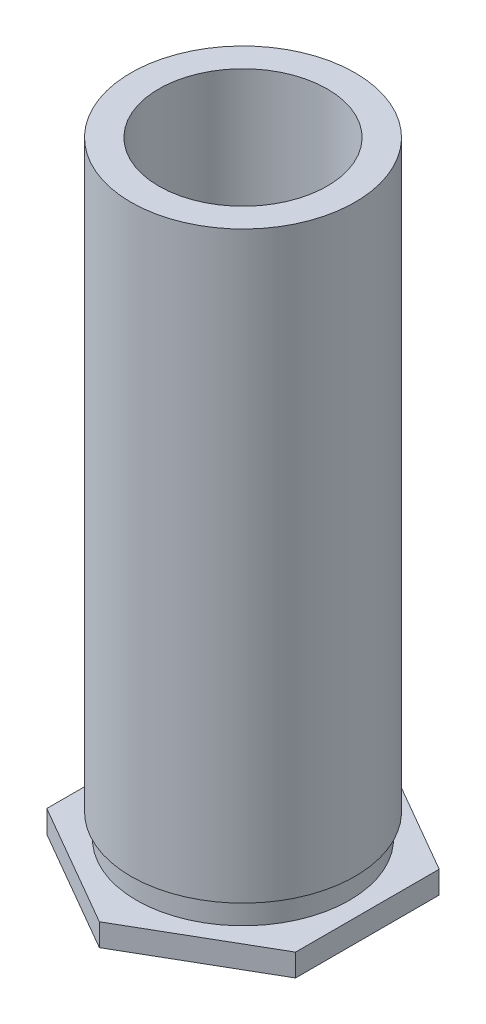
ISO-10303-21;
HEADER;
FILE_DESCRIPTION(('STEP AP214'),'2;1');
FILE_NAME('part.step','',(''),(''),'','','');
FILE_SCHEMA(('AUTOMOTIVE_DESIGN { 1 0 10303 214 1 1 1 1 }'));
ENDSEC;
DATA;
#1=APPLICATION_CONTEXT('core data for automotive mechanical design processes');
#2=APPLICATION_PROTOCOL_DEFINITION('international standard','automotive_design',2000,#1);
#3=PRODUCT_CONTEXT('',#1,'mechanical');
#4=PRODUCT('Part','Part','',(#3));
#5=PRODUCT_RELATED_PRODUCT_CATEGORY('part','',(#4));
#6=PRODUCT_DEFINITION_FORMATION('','',#4);
#7=PRODUCT_DEFINITION_CONTEXT('part definition',#1,'design');
#8=PRODUCT_DEFINITION('design','',#6,#7);
#9=PRODUCT_DEFINITION_SHAPE('','',#8);
#10=(LENGTH_UNIT() NAMED_UNIT(*) SI_UNIT(.MILLI.,.METRE.));
#11=(NAMED_UNIT(*) PLANE_ANGLE_UNIT() SI_UNIT($,.RADIAN.));
#12=(NAMED_UNIT(*) SI_UNIT($,.STERADIAN.) SOLID_ANGLE_UNIT());
#13=UNCERTAINTY_MEASURE_WITH_UNIT(LENGTH_MEASURE(1.E-05),#10,'distance_accuracy_value','');
#14=(GEOMETRIC_REPRESENTATION_CONTEXT(3) GLOBAL_UNCERTAINTY_ASSIGNED_CONTEXT((#13)) GLOBAL_UNIT_ASSIGNED_CONTEXT((#10,
#11,#12)) REPRESENTATION_CONTEXT('',''));
#15=CARTESIAN_POINT('',(0.,0.,0.));
#16=DIRECTION('',(0.,0.,1.));
#17=DIRECTION('',(1.,0.,0.));
#18=AXIS2_PLACEMENT_3D('',#15,#16,#17);
#19=CARTESIAN_POINT('',(4.582,0.712,0.));
#20=DIRECTION('',(0.,1.,0.));
#21=DIRECTION('',(0.,0.,1.));
#22=AXIS2_PLACEMENT_3D('',#19,#20,#21);
#23=PLANE('',#22);
#24=CARTESIAN_POINT('',(0.,0.712,0.));
#25=DIRECTION('',(0.,-1.,0.));
#26=DIRECTION('',(0.,0.,-1.));
#27=AXIS2_PLACEMENT_3D('',#24,#25,#26);
#28=CIRCLE('',#27,3.382);
#29=CARTESIAN_POINT('',(0.,0.712,-3.382));
#30=VERTEX_POINT('',#29);
#31=EDGE_CURVE('E11',#30,#30,#28,.T.);
#32=ORIENTED_EDGE('',*,*,#31,.T.);
#33=EDGE_LOOP('',(#32));
#34=FACE_BOUND('',#33,.T.);
#35=DIRECTION('',(0.866025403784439,0.,0.5));
#36=VECTOR('',#35,1.);
#37=CARTESIAN_POINT('',(0.,0.712,4.56106712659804));
#38=LINE('',#37,#36);
#39=CARTESIAN_POINT('',(-3.95,0.712,2.28053356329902));
#40=VERTEX_POINT('',#39);
#41=CARTESIAN_POINT('',(0.,0.712,4.56106712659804));
#42=VERTEX_POINT('',#41);
#43=EDGE_CURVE('E129',#40,#42,#38,.T.);
#44=ORIENTED_EDGE('',*,*,#43,.T.);
#45=DIRECTION('',(0.866025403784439,0.,-0.5));
#46=VECTOR('',#45,1.);
#47=CARTESIAN_POINT('',(3.95,0.712,2.28053356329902));
#48=LINE('',#47,#46);
#49=CARTESIAN_POINT('',(3.95,0.712,2.28053356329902));
#50=VERTEX_POINT('',#49);
#51=EDGE_CURVE('E118',#42,#50,#48,.T.);
#52=ORIENTED_EDGE('',*,*,#51,.T.);
#53=DIRECTION('',(0.,0.,-1.));
#54=VECTOR('',#53,1.);
#55=CARTESIAN_POINT('',(3.95,0.712,-2.28053356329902));
#56=LINE('',#55,#54);
#57=CARTESIAN_POINT('',(3.95,0.712,-2.28053356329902));
#58=VERTEX_POINT('',#57);
#59=EDGE_CURVE('E121',#50,#58,#56,.T.);
#60=ORIENTED_EDGE('',*,*,#59,.T.);
#61=DIRECTION('',(-0.866025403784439,0.,-0.5));
#62=VECTOR('',#61,1.);
#63=CARTESIAN_POINT('',(0.,0.712,-4.56106712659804));
#64=LINE('',#63,#62);
#65=CARTESIAN_POINT('',(0.,0.712,-4.56106712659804));
#66=VERTEX_POINT('',#65);
#67=EDGE_CURVE('E49',#58,#66,#64,.T.);
#68=ORIENTED_EDGE('',*,*,#67,.T.);
#69=DIRECTION('',(-0.866025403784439,0.,0.5));
#70=VECTOR('',#69,1.);
#71=CARTESIAN_POINT('',(-3.95,0.712,-2.28053356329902));
#72=LINE('',#71,#70);
#73=CARTESIAN_POINT('',(-3.95,0.712,-2.28053356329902));
#74=VERTEX_POINT('',#73);
#75=EDGE_CURVE('E94',#66,#74,#72,.T.);
#76=ORIENTED_EDGE('',*,*,#75,.T.);
#77=DIRECTION('',(0.,0.,1.));
#78=VECTOR('',#77,1.);
#79=CARTESIAN_POINT('',(-3.95,0.712,2.28053356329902));
#80=LINE('',#79,#78);
#81=EDGE_CURVE('E126',#74,#40,#80,.T.);
#82=ORIENTED_EDGE('',*,*,#81,.T.);
#83=EDGE_LOOP('',(#44,#52,#60,#68,#76,#82));
#84=FACE_BOUND('',#83,.T.);
#85=ADVANCED_FACE('F33',(#34,#84),#23,.T.);
#86=CARTESIAN_POINT('',(3.56,0.,0.));
#87=DIRECTION('',(0.,-1.,0.));
#88=DIRECTION('',(0.,0.,-1.));
#89=AXIS2_PLACEMENT_3D('',#86,#87,#88);
#90=PLANE('',#89);
#91=CARTESIAN_POINT('',(0.,0.,0.));
#92=DIRECTION('',(0.,-1.,0.));
#93=DIRECTION('',(0.,0.,-1.));
#94=AXIS2_PLACEMENT_3D('',#91,#92,#93);
#95=CIRCLE('',#94,3.56);
#96=CARTESIAN_POINT('',(0.,0.,-3.56));
#97=VERTEX_POINT('',#96);
#98=EDGE_CURVE('E281',#97,#97,#95,.T.);
#99=ORIENTED_EDGE('',*,*,#98,.F.);
#100=EDGE_LOOP('',(#99));
#101=FACE_BOUND('',#100,.T.);
#102=DIRECTION('',(0.,0.,-1.));
#103=VECTOR('',#102,1.);
#104=CARTESIAN_POINT('',(3.95,0.,-2.28053356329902));
#105=LINE('',#104,#103);
#106=CARTESIAN_POINT('',(3.95,0.,2.28053356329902));
#107=VERTEX_POINT('',#106);
#108=CARTESIAN_POINT('',(3.95,0.,-2.28053356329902));
#109=VERTEX_POINT('',#108);
#110=EDGE_CURVE('E104',#107,#109,#105,.T.);
#111=ORIENTED_EDGE('',*,*,#110,.F.);
#112=DIRECTION('',(0.866025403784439,0.,-0.5));
#113=VECTOR('',#112,1.);
#114=CARTESIAN_POINT('',(3.95,0.,2.28053356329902));
#115=LINE('',#114,#113);
#116=CARTESIAN_POINT('',(0.,0.,4.56106712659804));
#117=VERTEX_POINT('',#116);
#118=EDGE_CURVE('E57',#117,#107,#115,.T.);
#119=ORIENTED_EDGE('',*,*,#118,.F.);
#120=DIRECTION('',(0.866025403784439,0.,0.5));
#121=VECTOR('',#120,1.);
#122=CARTESIAN_POINT('',(0.,0.,4.56106712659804));
#123=LINE('',#122,#121);
#124=CARTESIAN_POINT('',(-3.95,0.,2.28053356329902));
#125=VERTEX_POINT('',#124);
#126=EDGE_CURVE('E111',#125,#117,#123,.T.);
#127=ORIENTED_EDGE('',*,*,#126,.F.);
#128=DIRECTION('',(0.,0.,1.));
#129=VECTOR('',#128,1.);
#130=CARTESIAN_POINT('',(-3.95,0.,2.28053356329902));
#131=LINE('',#130,#129);
#132=CARTESIAN_POINT('',(-3.95,0.,-2.28053356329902));
#133=VERTEX_POINT('',#132);
#134=EDGE_CURVE('E109',#133,#125,#131,.T.);
#135=ORIENTED_EDGE('',*,*,#134,.F.);
#136=DIRECTION('',(-0.866025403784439,0.,0.5));
#137=VECTOR('',#136,1.);
#138=CARTESIAN_POINT('',(-3.95,0.,-2.28053356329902));
#139=LINE('',#138,#137);
#140=CARTESIAN_POINT('',(0.,0.,-4.56106712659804));
#141=VERTEX_POINT('',#140);
#142=EDGE_CURVE('E91',#141,#133,#139,.T.);
#143=ORIENTED_EDGE('',*,*,#142,.F.);
#144=DIRECTION('',(-0.866025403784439,0.,-0.5));
#145=VECTOR('',#144,1.);
#146=CARTESIAN_POINT('',(0.,0.,-4.56106712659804));
#147=LINE('',#146,#145);
#148=EDGE_CURVE('E99',#109,#141,#147,.T.);
#149=ORIENTED_EDGE('',*,*,#148,.F.);
#150=EDGE_LOOP('',(#111,#119,#127,#135,#143,#149));
#151=FACE_BOUND('',#150,.T.);
#152=ADVANCED_FACE('F106',(#101,#151),#90,.T.);
#153=CARTESIAN_POINT('',(0.,0.,0.));
#154=DIRECTION('',(0.,-1.,0.));
#155=DIRECTION('',(0.,0.,-1.));
#156=AXIS2_PLACEMENT_3D('',#153,#154,#155);
#157=CYLINDRICAL_SURFACE('',#156,2.1);
#158=CARTESIAN_POINT('',(0.,0.286083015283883,0.));
#159=DIRECTION('',(0.,-1.,0.));
#160=DIRECTION('',(0.,0.,-1.));
#161=AXIS2_PLACEMENT_3D('',#158,#159,#160);
#162=CIRCLE('',#161,2.1);
#163=CARTESIAN_POINT('',(0.,0.286083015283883,-2.1));
#164=VERTEX_POINT('',#163);
#165=EDGE_CURVE('E142',#164,#164,#162,.T.);
#166=ORIENTED_EDGE('',*,*,#165,.T.);
#167=EDGE_LOOP('',(#166));
#168=FACE_BOUND('',#167,.T.);
#169=CARTESIAN_POINT('',(0.,0.525516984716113,0.));
#170=DIRECTION('',(0.,-1.,0.));
#171=DIRECTION('',(0.,0.,-1.));
#172=AXIS2_PLACEMENT_3D('',#169,#170,#171);
#173=CIRCLE('',#172,2.1);
#174=CARTESIAN_POINT('',(0.,0.525516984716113,-2.1));
#175=VERTEX_POINT('',#174);
#176=EDGE_CURVE('E151',#175,#175,#173,.T.);
#177=ORIENTED_EDGE('',*,*,#176,.F.);
#178=EDGE_LOOP('',(#177));
#179=FACE_BOUND('',#178,.T.);
#180=ADVANCED_FACE('F480',(#168,#179),#157,.F.);
#181=CARTESIAN_POINT('',(0.,1.08568301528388,0.));
#182=DIRECTION('',(0.,-1.,0.));
#183=DIRECTION('',(0.,0.,-1.));
#184=AXIS2_PLACEMENT_3D('',#181,#182,#183);
#185=CIRCLE('',#184,2.1);
#186=CARTESIAN_POINT('',(0.,1.08568301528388,-2.1));
#187=VERTEX_POINT('',#186);
#188=EDGE_CURVE('E148',#187,#187,#185,.T.);
#189=ORIENTED_EDGE('',*,*,#188,.T.);
#190=EDGE_LOOP('',(#189));
#191=FACE_BOUND('',#190,.T.);
#192=CARTESIAN_POINT('',(0.,1.32511698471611,0.));
#193=DIRECTION('',(0.,-1.,0.));
#194=DIRECTION('',(0.,0.,-1.));
#195=AXIS2_PLACEMENT_3D('',#192,#193,#194);
#196=CIRCLE('',#195,2.1);
#197=CARTESIAN_POINT('',(0.,1.32511698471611,-2.1));
#198=VERTEX_POINT('',#197);
#199=EDGE_CURVE('E160',#198,#198,#196,.T.);
#200=ORIENTED_EDGE('',*,*,#199,.F.);
#201=EDGE_LOOP('',(#200));
#202=FACE_BOUND('',#201,.T.);
#203=ADVANCED_FACE('F495',(#191,#202),#157,.F.);
#204=CARTESIAN_POINT('',(0.,1.88528301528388,0.));
#205=DIRECTION('',(0.,-1.,0.));
#206=DIRECTION('',(0.,0.,-1.));
#207=AXIS2_PLACEMENT_3D('',#204,#205,#206);
#208=CIRCLE('',#207,2.1);
#209=CARTESIAN_POINT('',(0.,1.88528301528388,-2.1));
#210=VERTEX_POINT('',#209);
#211=EDGE_CURVE('E157',#210,#210,#208,.T.);
#212=ORIENTED_EDGE('',*,*,#211,.T.);
#213=EDGE_LOOP('',(#212));
#214=FACE_BOUND('',#213,.T.);
#215=CARTESIAN_POINT('',(0.,2.12471698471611,0.));
#216=DIRECTION('',(0.,-1.,0.));
#217=DIRECTION('',(0.,0.,-1.));
#218=AXIS2_PLACEMENT_3D('',#215,#216,#217);
#219=CIRCLE('',#218,2.1);
#220=CARTESIAN_POINT('',(0.,2.12471698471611,-2.1));
#221=VERTEX_POINT('',#220);
#222=EDGE_CURVE('E169',#221,#221,#219,.T.);
#223=ORIENTED_EDGE('',*,*,#222,.F.);
#224=EDGE_LOOP('',(#223));
#225=FACE_BOUND('',#224,.T.);
#226=ADVANCED_FACE('F605',(#214,#225),#157,.F.);
#227=CARTESIAN_POINT('',(0.,2.68488301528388,0.));
#228=DIRECTION('',(0.,-1.,0.));
#229=DIRECTION('',(0.,0.,-1.));
#230=AXIS2_PLACEMENT_3D('',#227,#228,#229);
#231=CIRCLE('',#230,2.1);
#232=CARTESIAN_POINT('',(0.,2.68488301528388,-2.1));
#233=VERTEX_POINT('',#232);
#234=EDGE_CURVE('E166',#233,#233,#231,.T.);
#235=ORIENTED_EDGE('',*,*,#234,.T.);
#236=EDGE_LOOP('',(#235));
#237=FACE_BOUND('',#236,.T.);
#238=CARTESIAN_POINT('',(0.,2.92431698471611,0.));
#239=DIRECTION('',(0.,-1.,0.));
#240=DIRECTION('',(0.,0.,-1.));
#241=AXIS2_PLACEMENT_3D('',#238,#239,#240);
#242=CIRCLE('',#241,2.1);
#243=CARTESIAN_POINT('',(0.,2.92431698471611,-2.1));
#244=VERTEX_POINT('',#243);
#245=EDGE_CURVE('E178',#244,#244,#242,.T.);
#246=ORIENTED_EDGE('',*,*,#245,.F.);
#247=EDGE_LOOP('',(#246));
#248=FACE_BOUND('',#247,.T.);
#249=ADVANCED_FACE('F594',(#237,#248),#157,.F.);
#250=CARTESIAN_POINT('',(0.,3.48448301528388,0.));
#251=DIRECTION('',(0.,-1.,0.));
#252=DIRECTION('',(0.,0.,-1.));
#253=AXIS2_PLACEMENT_3D('',#250,#251,#252);
#254=CIRCLE('',#253,2.1);
#255=CARTESIAN_POINT('',(0.,3.48448301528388,-2.1));
#256=VERTEX_POINT('',#255);
#257=EDGE_CURVE('E175',#256,#256,#254,.T.);
#258=ORIENTED_EDGE('',*,*,#257,.T.);
#259=EDGE_LOOP('',(#258));
#260=FACE_BOUND('',#259,.T.);
#261=CARTESIAN_POINT('',(0.,3.72391698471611,0.));
#262=DIRECTION('',(0.,-1.,0.));
#263=DIRECTION('',(0.,0.,-1.));
#264=AXIS2_PLACEMENT_3D('',#261,#262,#263);
#265=CIRCLE('',#264,2.1);
#266=CARTESIAN_POINT('',(0.,3.72391698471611,-2.1));
#267=VERTEX_POINT('',#266);
#268=EDGE_CURVE('E187',#267,#267,#265,.T.);
#269=ORIENTED_EDGE('',*,*,#268,.F.);
#270=EDGE_LOOP('',(#269));
#271=FACE_BOUND('',#270,.T.);
#272=ADVANCED_FACE('F583',(#260,#271),#157,.F.);
#273=CARTESIAN_POINT('',(0.,4.28408301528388,0.));
#274=DIRECTION('',(0.,-1.,0.));
#275=DIRECTION('',(0.,0.,-1.));
#276=AXIS2_PLACEMENT_3D('',#273,#274,#275);
#277=CIRCLE('',#276,2.1);
#278=CARTESIAN_POINT('',(0.,4.28408301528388,-2.1));
#279=VERTEX_POINT('',#278);
#280=EDGE_CURVE('E184',#279,#279,#277,.T.);
#281=ORIENTED_EDGE('',*,*,#280,.T.);
#282=EDGE_LOOP('',(#281));
#283=FACE_BOUND('',#282,.T.);
#284=CARTESIAN_POINT('',(0.,4.52351698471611,0.));
#285=DIRECTION('',(0.,-1.,0.));
#286=DIRECTION('',(0.,0.,-1.));
#287=AXIS2_PLACEMENT_3D('',#284,#285,#286);
#288=CIRCLE('',#287,2.1);
#289=CARTESIAN_POINT('',(0.,4.52351698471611,-2.1));
#290=VERTEX_POINT('',#289);
#291=EDGE_CURVE('E196',#290,#290,#288,.T.);
#292=ORIENTED_EDGE('',*,*,#291,.F.);
#293=EDGE_LOOP('',(#292));
#294=FACE_BOUND('',#293,.T.);
#295=ADVANCED_FACE('F572',(#283,#294),#157,.F.);
#296=CARTESIAN_POINT('',(0.,5.08368301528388,0.));
#297=DIRECTION('',(0.,-1.,0.));
#298=DIRECTION('',(0.,0.,-1.));
#299=AXIS2_PLACEMENT_3D('',#296,#297,#298);
#300=CIRCLE('',#299,2.1);
#301=CARTESIAN_POINT('',(0.,5.08368301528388,-2.1));
#302=VERTEX_POINT('',#301);
#303=EDGE_CURVE('E193',#302,#302,#300,.T.);
#304=ORIENTED_EDGE('',*,*,#303,.T.);
#305=EDGE_LOOP('',(#304));
#306=FACE_BOUND('',#305,.T.);
#307=CARTESIAN_POINT('',(0.,5.32311698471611,0.));
#308=DIRECTION('',(0.,-1.,0.));
#309=DIRECTION('',(0.,0.,-1.));
#310=AXIS2_PLACEMENT_3D('',#307,#308,#309);
#311=CIRCLE('',#310,2.1);
#312=CARTESIAN_POINT('',(0.,5.32311698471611,-2.1));
#313=VERTEX_POINT('',#312);
#314=EDGE_CURVE('E205',#313,#313,#311,.T.);
#315=ORIENTED_EDGE('',*,*,#314,.F.);
#316=EDGE_LOOP('',(#315));
#317=FACE_BOUND('',#316,.T.);
#318=ADVANCED_FACE('F561',(#306,#317),#157,.F.);
#319=CARTESIAN_POINT('',(0.,5.88328301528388,0.));
#320=DIRECTION('',(0.,-1.,0.));
#321=DIRECTION('',(0.,0.,-1.));
#322=AXIS2_PLACEMENT_3D('',#319,#320,#321);
#323=CIRCLE('',#322,2.1);
#324=CARTESIAN_POINT('',(0.,5.88328301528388,-2.1));
#325=VERTEX_POINT('',#324);
#326=EDGE_CURVE('E202',#325,#325,#323,.T.);
#327=ORIENTED_EDGE('',*,*,#326,.T.);
#328=EDGE_LOOP('',(#327));
#329=FACE_BOUND('',#328,.T.);
#330=CARTESIAN_POINT('',(0.,6.12271698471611,0.));
#331=DIRECTION('',(0.,-1.,0.));
#332=DIRECTION('',(0.,0.,-1.));
#333=AXIS2_PLACEMENT_3D('',#330,#331,#332);
#334=CIRCLE('',#333,2.1);
#335=CARTESIAN_POINT('',(0.,6.12271698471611,-2.1));
#336=VERTEX_POINT('',#335);
#337=EDGE_CURVE('E214',#336,#336,#334,.T.);
#338=ORIENTED_EDGE('',*,*,#337,.F.);
#339=EDGE_LOOP('',(#338));
#340=FACE_BOUND('',#339,.T.);
#341=ADVANCED_FACE('F550',(#329,#340),#157,.F.);
#342=CARTESIAN_POINT('',(0.,6.68288301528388,0.));
#343=DIRECTION('',(0.,-1.,0.));
#344=DIRECTION('',(0.,0.,-1.));
#345=AXIS2_PLACEMENT_3D('',#342,#343,#344);
#346=CIRCLE('',#345,2.1);
#347=CARTESIAN_POINT('',(0.,6.68288301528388,-2.1));
#348=VERTEX_POINT('',#347);
#349=EDGE_CURVE('E211',#348,#348,#346,.T.);
#350=ORIENTED_EDGE('',*,*,#349,.T.);
#351=EDGE_LOOP('',(#350));
#352=FACE_BOUND('',#351,.T.);
#353=CARTESIAN_POINT('',(0.,6.92231698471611,0.));
#354=DIRECTION('',(0.,-1.,0.));
#355=DIRECTION('',(0.,0.,-1.));
#356=AXIS2_PLACEMENT_3D('',#353,#354,#355);
#357=CIRCLE('',#356,2.1);
#358=CARTESIAN_POINT('',(0.,6.92231698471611,-2.1));
#359=VERTEX_POINT('',#358);
#360=EDGE_CURVE('E223',#359,#359,#357,.T.);
#361=ORIENTED_EDGE('',*,*,#360,.F.);
#362=EDGE_LOOP('',(#361));
#363=FACE_BOUND('',#362,.T.);
#364=ADVANCED_FACE('F539',(#352,#363),#157,.F.);
#365=CARTESIAN_POINT('',(0.,7.48248301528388,0.));
#366=DIRECTION('',(0.,-1.,0.));
#367=DIRECTION('',(0.,0.,-1.));
#368=AXIS2_PLACEMENT_3D('',#365,#366,#367);
#369=CIRCLE('',#368,2.1);
#370=CARTESIAN_POINT('',(0.,7.48248301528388,-2.1));
#371=VERTEX_POINT('',#370);
#372=EDGE_CURVE('E220',#371,#371,#369,.T.);
#373=ORIENTED_EDGE('',*,*,#372,.T.);
#374=EDGE_LOOP('',(#373));
#375=FACE_BOUND('',#374,.T.);
#376=CARTESIAN_POINT('',(0.,7.72191698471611,0.));
#377=DIRECTION('',(0.,-1.,0.));
#378=DIRECTION('',(0.,0.,-1.));
#379=AXIS2_PLACEMENT_3D('',#376,#377,#378);
#380=CIRCLE('',#379,2.1);
#381=CARTESIAN_POINT('',(0.,7.72191698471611,-2.1));
#382=VERTEX_POINT('',#381);
#383=EDGE_CURVE('E232',#382,#382,#380,.T.);
#384=ORIENTED_EDGE('',*,*,#383,.F.);
#385=EDGE_LOOP('',(#384));
#386=FACE_BOUND('',#385,.T.);
#387=ADVANCED_FACE('F528',(#375,#386),#157,.F.);
#388=CARTESIAN_POINT('',(0.,8.28208301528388,0.));
#389=DIRECTION('',(0.,-1.,0.));
#390=DIRECTION('',(0.,0.,-1.));
#391=AXIS2_PLACEMENT_3D('',#388,#389,#390);
#392=CIRCLE('',#391,2.1);
#393=CARTESIAN_POINT('',(0.,8.28208301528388,-2.1));
#394=VERTEX_POINT('',#393);
#395=EDGE_CURVE('E229',#394,#394,#392,.T.);
#396=ORIENTED_EDGE('',*,*,#395,.T.);
#397=EDGE_LOOP('',(#396));
#398=FACE_BOUND('',#397,.T.);
#399=CARTESIAN_POINT('',(0.,8.52151698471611,0.));
#400=DIRECTION('',(0.,-1.,0.));
#401=DIRECTION('',(0.,0.,-1.));
#402=AXIS2_PLACEMENT_3D('',#399,#400,#401);
#403=CIRCLE('',#402,2.1);
#404=CARTESIAN_POINT('',(0.,8.52151698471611,-2.1));
#405=VERTEX_POINT('',#404);
#406=EDGE_CURVE('E241',#405,#405,#403,.T.);
#407=ORIENTED_EDGE('',*,*,#406,.F.);
#408=EDGE_LOOP('',(#407));
#409=FACE_BOUND('',#408,.T.);
#410=ADVANCED_FACE('F517',(#398,#409),#157,.F.);
#411=CARTESIAN_POINT('',(0.,9.08168301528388,0.));
#412=DIRECTION('',(0.,-1.,0.));
#413=DIRECTION('',(0.,0.,-1.));
#414=AXIS2_PLACEMENT_3D('',#411,#412,#413);
#415=CIRCLE('',#414,2.1);
#416=CARTESIAN_POINT('',(0.,9.08168301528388,-2.1));
#417=VERTEX_POINT('',#416);
#418=EDGE_CURVE('E238',#417,#417,#415,.T.);
#419=ORIENTED_EDGE('',*,*,#418,.T.);
#420=EDGE_LOOP('',(#419));
#421=FACE_BOUND('',#420,.T.);
#422=CARTESIAN_POINT('',(0.,9.32111698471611,0.));
#423=DIRECTION('',(0.,-1.,0.));
#424=DIRECTION('',(0.,0.,-1.));
#425=AXIS2_PLACEMENT_3D('',#422,#423,#424);
#426=CIRCLE('',#425,2.1);
#427=CARTESIAN_POINT('',(0.,9.32111698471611,-2.1));
#428=VERTEX_POINT('',#427);
#429=EDGE_CURVE('E250',#428,#428,#426,.T.);
#430=ORIENTED_EDGE('',*,*,#429,.F.);
#431=EDGE_LOOP('',(#430));
#432=FACE_BOUND('',#431,.T.);
#433=ADVANCED_FACE('F503',(#421,#432),#157,.F.);
#434=CARTESIAN_POINT('',(0.,9.88128301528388,0.));
#435=DIRECTION('',(0.,-1.,0.));
#436=DIRECTION('',(0.,0.,-1.));
#437=AXIS2_PLACEMENT_3D('',#434,#435,#436);
#438=CIRCLE('',#437,2.1);
#439=CARTESIAN_POINT('',(0.,9.88128301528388,-2.1));
#440=VERTEX_POINT('',#439);
#441=EDGE_CURVE('E247',#440,#440,#438,.T.);
#442=ORIENTED_EDGE('',*,*,#441,.T.);
#443=EDGE_LOOP('',(#442));
#444=FACE_BOUND('',#443,.T.);
#445=CARTESIAN_POINT('',(0.,10.1207169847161,0.));
#446=DIRECTION('',(0.,-1.,0.));
#447=DIRECTION('',(0.,0.,-1.));
#448=AXIS2_PLACEMENT_3D('',#445,#446,#447);
#449=CIRCLE('',#448,2.1);
#450=CARTESIAN_POINT('',(0.,10.1207169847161,-2.1));
#451=VERTEX_POINT('',#450);
#452=EDGE_CURVE('E259',#451,#451,#449,.T.);
#453=ORIENTED_EDGE('',*,*,#452,.F.);
#454=EDGE_LOOP('',(#453));
#455=FACE_BOUND('',#454,.T.);
#456=ADVANCED_FACE('F498',(#444,#455),#157,.F.);
#457=CARTESIAN_POINT('',(0.,10.6808830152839,0.));
#458=DIRECTION('',(0.,-1.,0.));
#459=DIRECTION('',(0.,0.,-1.));
#460=AXIS2_PLACEMENT_3D('',#457,#458,#459);
#461=CIRCLE('',#460,2.1);
#462=CARTESIAN_POINT('',(0.,10.6808830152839,-2.1));
#463=VERTEX_POINT('',#462);
#464=EDGE_CURVE('E256',#463,#463,#461,.T.);
#465=ORIENTED_EDGE('',*,*,#464,.T.);
#466=EDGE_LOOP('',(#465));
#467=FACE_BOUND('',#466,.T.);
#468=CARTESIAN_POINT('',(0.,10.9203169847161,0.));
#469=DIRECTION('',(0.,-1.,0.));
#470=DIRECTION('',(0.,0.,-1.));
#471=AXIS2_PLACEMENT_3D('',#468,#469,#470);
#472=CIRCLE('',#471,2.1);
#473=CARTESIAN_POINT('',(0.,10.9203169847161,-2.1));
#474=VERTEX_POINT('',#473);
#475=EDGE_CURVE('E268',#474,#474,#472,.T.);
#476=ORIENTED_EDGE('',*,*,#475,.F.);
#477=EDGE_LOOP('',(#476));
#478=FACE_BOUND('',#477,.T.);
#479=ADVANCED_FACE('F322',(#467,#478),#157,.F.);
#480=CARTESIAN_POINT('',(0.,0.,0.));
#481=DIRECTION('',(0.,-1.,0.));
#482=DIRECTION('',(0.,0.,-1.));
#483=AXIS2_PLACEMENT_3D('',#480,#481,#482);
#484=CYLINDRICAL_SURFACE('',#483,3.382);
#485=CARTESIAN_POINT('',(0.,1.4596,0.));
#486=DIRECTION('',(0.,-1.,0.));
#487=DIRECTION('',(0.,0.,-1.));
#488=AXIS2_PLACEMENT_3D('',#485,#486,#487);
#489=CIRCLE('',#488,3.382);
#490=CARTESIAN_POINT('',(0.,1.4596,-3.382));
#491=VERTEX_POINT('',#490);
#492=EDGE_CURVE('E41',#491,#491,#489,.T.);
#493=ORIENTED_EDGE('',*,*,#492,.T.);
#494=EDGE_LOOP('',(#493));
#495=FACE_BOUND('',#494,.T.);
#496=ORIENTED_EDGE('',*,*,#31,.F.);
#497=EDGE_LOOP('',(#496));
#498=FACE_BOUND('',#497,.T.);
#499=ADVANCED_FACE('F316',(#495,#498),#484,.T.);
#500=CARTESIAN_POINT('',(3.56,1.4596,0.));
#501=DIRECTION('',(0.,-1.,0.));
#502=DIRECTION('',(0.,0.,-1.));
#503=AXIS2_PLACEMENT_3D('',#500,#501,#502);
#504=PLANE('',#503);
#505=CARTESIAN_POINT('',(0.,1.4596,0.));
#506=DIRECTION('',(0.,-1.,0.));
#507=DIRECTION('',(0.,0.,-1.));
#508=AXIS2_PLACEMENT_3D('',#505,#506,#507);
#509=CIRCLE('',#508,3.56);
#510=CARTESIAN_POINT('',(0.,1.4596,-3.56));
#511=VERTEX_POINT('',#510);
#512=EDGE_CURVE('E290',#511,#511,#509,.T.);
#513=ORIENTED_EDGE('',*,*,#512,.T.);
#514=EDGE_LOOP('',(#513));
#515=FACE_BOUND('',#514,.T.);
#516=ORIENTED_EDGE('',*,*,#492,.F.);
#517=EDGE_LOOP('',(#516));
#518=FACE_BOUND('',#517,.T.);
#519=ADVANCED_FACE('F310',(#515,#518),#504,.T.);
#520=CARTESIAN_POINT('',(0.,0.,0.));
#521=DIRECTION('',(0.,-1.,0.));
#522=DIRECTION('',(0.,0.,-1.));
#523=AXIS2_PLACEMENT_3D('',#520,#521,#522);
#524=CYLINDRICAL_SURFACE('',#523,3.56);
#525=CARTESIAN_POINT('',(0.,20.,0.));
#526=DIRECTION('',(0.,-1.,0.));
#527=DIRECTION('',(0.,0.,-1.));
#528=AXIS2_PLACEMENT_3D('',#525,#526,#527);
#529=CIRCLE('',#528,3.56);
#530=CARTESIAN_POINT('',(0.,20.,-3.56));
#531=VERTEX_POINT('',#530);
#532=EDGE_CURVE('E287',#531,#531,#529,.T.);
#533=ORIENTED_EDGE('',*,*,#532,.T.);
#534=EDGE_LOOP('',(#533));
#535=FACE_BOUND('',#534,.T.);
#536=ORIENTED_EDGE('',*,*,#512,.F.);
#537=EDGE_LOOP('',(#536));
#538=FACE_BOUND('',#537,.T.);
#539=ADVANCED_FACE('F304',(#535,#538),#524,.T.);
#540=CARTESIAN_POINT('',(3.56,20.,0.));
#541=DIRECTION('',(0.,1.,0.));
#542=DIRECTION('',(0.,0.,1.));
#543=AXIS2_PLACEMENT_3D('',#540,#541,#542);
#544=PLANE('',#543);
#545=CARTESIAN_POINT('',(0.,20.,0.));
#546=DIRECTION('',(0.,1.,0.));
#547=DIRECTION('',(0.,0.,1.));
#548=AXIS2_PLACEMENT_3D('',#545,#546,#547);
#549=CIRCLE('',#548,2.675);
#550=CARTESIAN_POINT('',(0.,20.,2.675));
#551=VERTEX_POINT('',#550);
#552=EDGE_CURVE('E280',#551,#551,#549,.T.);
#553=ORIENTED_EDGE('',*,*,#552,.F.);
#554=EDGE_LOOP('',(#553));
#555=FACE_BOUND('',#554,.T.);
#556=ORIENTED_EDGE('',*,*,#532,.F.);
#557=EDGE_LOOP('',(#556));
#558=FACE_BOUND('',#557,.T.);
#559=ADVANCED_FACE('F300',(#555,#558),#544,.T.);
#560=CARTESIAN_POINT('',(0.,11.4804830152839,0.));
#561=DIRECTION('',(0.,-1.,0.));
#562=DIRECTION('',(0.,0.,-1.));
#563=AXIS2_PLACEMENT_3D('',#560,#561,#562);
#564=CIRCLE('',#563,2.1);
#565=CARTESIAN_POINT('',(0.,11.4804830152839,-2.1));
#566=VERTEX_POINT('',#565);
#567=EDGE_CURVE('E265',#566,#566,#564,.T.);
#568=ORIENTED_EDGE('',*,*,#567,.T.);
#569=EDGE_LOOP('',(#568));
#570=FACE_BOUND('',#569,.T.);
#571=CARTESIAN_POINT('',(0.,11.7199169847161,0.));
#572=DIRECTION('',(0.,-1.,0.));
#573=DIRECTION('',(0.,0.,-1.));
#574=AXIS2_PLACEMENT_3D('',#571,#572,#573);
#575=CIRCLE('',#574,2.1);
#576=CARTESIAN_POINT('',(0.,11.7199169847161,-2.1));
#577=VERTEX_POINT('',#576);
#578=EDGE_CURVE('E274',#577,#577,#575,.T.);
#579=ORIENTED_EDGE('',*,*,#578,.F.);
#580=EDGE_LOOP('',(#579));
#581=FACE_BOUND('',#580,.T.);
#582=ADVANCED_FACE('F303',(#570,#581),#157,.F.);
#583=CARTESIAN_POINT('',(3.56,0.00253999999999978,0.));
#584=DIRECTION('',(0.,-1.,0.));
#585=DIRECTION('',(0.,0.,-1.));
#586=AXIS2_PLACEMENT_3D('',#583,#584,#585);
#587=PLANE('',#586);
#588=CARTESIAN_POINT('',(0.,0.00253999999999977,0.));
#589=DIRECTION('',(0.,-1.,0.));
#590=DIRECTION('',(0.,0.,-1.));
#591=AXIS2_PLACEMENT_3D('',#588,#589,#590);
#592=CIRCLE('',#591,2.49505860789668);
#593=CARTESIAN_POINT('',(0.,0.00253999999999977,-2.49505860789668));
#594=VERTEX_POINT('',#593);
#595=EDGE_CURVE('E36',#594,#594,#592,.T.);
#596=ORIENTED_EDGE('',*,*,#595,.F.);
#597=EDGE_LOOP('',(#596));
#598=FACE_BOUND('',#597,.T.);
#599=CARTESIAN_POINT('',(0.,0.00254,0.));
#600=DIRECTION('',(0.,-1.,0.));
#601=DIRECTION('',(0.,0.,-1.));
#602=AXIS2_PLACEMENT_3D('',#599,#600,#601);
#603=CIRCLE('',#602,3.56);
#604=CARTESIAN_POINT('',(0.,0.00254,-3.56));
#605=VERTEX_POINT('',#604);
#606=EDGE_CURVE('E284',#605,#605,#603,.T.);
#607=ORIENTED_EDGE('',*,*,#606,.T.);
#608=EDGE_LOOP('',(#607));
#609=FACE_BOUND('',#608,.T.);
#610=ADVANCED_FACE('F484',(#598,#609),#587,.T.);
#611=CARTESIAN_POINT('',(0.,0.,0.));
#612=DIRECTION('',(0.,-1.,0.));
#613=DIRECTION('',(0.,0.,-1.));
#614=AXIS2_PLACEMENT_3D('',#611,#612,#613);
#615=CYLINDRICAL_SURFACE('',#614,3.56);
#616=ORIENTED_EDGE('',*,*,#98,.T.);
#617=EDGE_LOOP('',(#616));
#618=FACE_BOUND('',#617,.T.);
#619=ORIENTED_EDGE('',*,*,#606,.F.);
#620=EDGE_LOOP('',(#619));
#621=FACE_BOUND('',#620,.T.);
#622=ADVANCED_FACE('F476',(#618,#621),#615,.F.);
#623=CARTESIAN_POINT('',(2.675,12.,0.));
#624=DIRECTION('',(0.,-1.,0.));
#625=DIRECTION('',(0.,0.,-1.));
#626=AXIS2_PLACEMENT_3D('',#623,#624,#625);
#627=PLANE('',#626);
#628=CARTESIAN_POINT('',(0.,12.,0.));
#629=DIRECTION('',(0.,-1.,0.));
#630=DIRECTION('',(0.,0.,-1.));
#631=AXIS2_PLACEMENT_3D('',#628,#629,#630);
#632=CIRCLE('',#631,2.675);
#633=CARTESIAN_POINT('',(0.,12.,-2.675));
#634=VERTEX_POINT('',#633);
#635=EDGE_CURVE('E277',#634,#634,#632,.T.);
#636=ORIENTED_EDGE('',*,*,#635,.F.);
#637=EDGE_LOOP('',(#636));
#638=FACE_BOUND('',#637,.T.);
#639=CARTESIAN_POINT('',(0.,12.,0.));
#640=DIRECTION('',(0.,-1.,0.));
#641=DIRECTION('',(0.,0.,-1.));
#642=AXIS2_PLACEMENT_3D('',#639,#640,#641);
#643=CIRCLE('',#642,2.5);
#644=CARTESIAN_POINT('',(0.,12.,-2.5));
#645=VERTEX_POINT('',#644);
#646=EDGE_CURVE('E271',#645,#645,#643,.T.);
#647=ORIENTED_EDGE('',*,*,#646,.T.);
#648=EDGE_LOOP('',(#647));
#649=FACE_BOUND('',#648,.T.);
#650=ADVANCED_FACE('F473',(#638,#649),#627,.F.);
#651=CARTESIAN_POINT('',(0.,-2.54,0.));
#652=DIRECTION('',(0.,-1.,0.));
#653=DIRECTION('',(0.,0.,-1.));
#654=AXIS2_PLACEMENT_3D('',#651,#652,#653);
#655=CYLINDRICAL_SURFACE('',#654,2.675);
#656=ORIENTED_EDGE('',*,*,#552,.T.);
#657=EDGE_LOOP('',(#656));
#658=FACE_BOUND('',#657,.T.);
#659=ORIENTED_EDGE('',*,*,#635,.T.);
#660=EDGE_LOOP('',(#659));
#661=FACE_BOUND('',#660,.T.);
#662=ADVANCED_FACE('F297',(#658,#661),#655,.F.);
#663=CARTESIAN_POINT('',(0.,11.7199169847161,0.));
#664=DIRECTION('',(0.,1.,0.));
#665=DIRECTION('',(0.,0.,1.));
#666=AXIS2_PLACEMENT_3D('',#663,#664,#665);
#667=CONICAL_SURFACE('',#666,2.1,0.959931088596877);
#668=ORIENTED_EDGE('',*,*,#646,.F.);
#669=EDGE_LOOP('',(#668));
#670=FACE_BOUND('',#669,.T.);
#671=ORIENTED_EDGE('',*,*,#578,.T.);
#672=EDGE_LOOP('',(#671));
#673=FACE_BOUND('',#672,.T.);
#674=ADVANCED_FACE('F466',(#670,#673),#667,.F.);
#675=CARTESIAN_POINT('',(0.,10.9203169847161,0.));
#676=DIRECTION('',(0.,1.,0.));
#677=DIRECTION('',(0.,0.,1.));
#678=AXIS2_PLACEMENT_3D('',#675,#676,#677);
#679=CONICAL_SURFACE('',#678,2.1,0.959931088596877);
#680=CARTESIAN_POINT('',(0.,11.2004,0.));
#681=DIRECTION('',(0.,-1.,0.));
#682=DIRECTION('',(0.,0.,-1.));
#683=AXIS2_PLACEMENT_3D('',#680,#681,#682);
#684=CIRCLE('',#683,2.5);
#685=CARTESIAN_POINT('',(0.,11.2004,-2.5));
#686=VERTEX_POINT('',#685);
#687=EDGE_CURVE('E262',#686,#686,#684,.T.);
#688=ORIENTED_EDGE('',*,*,#687,.F.);
#689=EDGE_LOOP('',(#688));
#690=FACE_BOUND('',#689,.T.);
#691=ORIENTED_EDGE('',*,*,#475,.T.);
#692=EDGE_LOOP('',(#691));
#693=FACE_BOUND('',#692,.T.);
#694=ADVANCED_FACE('F462',(#690,#693),#679,.F.);
#695=CARTESIAN_POINT('',(0.,11.2004,0.));
#696=DIRECTION('',(0.,-1.,0.));
#697=DIRECTION('',(0.,0.,-1.));
#698=AXIS2_PLACEMENT_3D('',#695,#696,#697);
#699=CONICAL_SURFACE('',#698,2.5,0.959931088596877);
#700=ORIENTED_EDGE('',*,*,#567,.F.);
#701=EDGE_LOOP('',(#700));
#702=FACE_BOUND('',#701,.T.);
#703=ORIENTED_EDGE('',*,*,#687,.T.);
#704=EDGE_LOOP('',(#703));
#705=FACE_BOUND('',#704,.T.);
#706=ADVANCED_FACE('F458',(#702,#705),#699,.F.);
#707=CARTESIAN_POINT('',(0.,10.1207169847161,0.));
#708=DIRECTION('',(0.,1.,0.));
#709=DIRECTION('',(0.,0.,1.));
#710=AXIS2_PLACEMENT_3D('',#707,#708,#709);
#711=CONICAL_SURFACE('',#710,2.1,0.959931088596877);
#712=CARTESIAN_POINT('',(0.,10.4008,0.));
#713=DIRECTION('',(0.,-1.,0.));
#714=DIRECTION('',(0.,0.,-1.));
#715=AXIS2_PLACEMENT_3D('',#712,#713,#714);
#716=CIRCLE('',#715,2.5);
#717=CARTESIAN_POINT('',(0.,10.4008,-2.5));
#718=VERTEX_POINT('',#717);
#719=EDGE_CURVE('E253',#718,#718,#716,.T.);
#720=ORIENTED_EDGE('',*,*,#719,.F.);
#721=EDGE_LOOP('',(#720));
#722=FACE_BOUND('',#721,.T.);
#723=ORIENTED_EDGE('',*,*,#452,.T.);
#724=EDGE_LOOP('',(#723));
#725=FACE_BOUND('',#724,.T.);
#726=ADVANCED_FACE('F454',(#722,#725),#711,.F.);
#727=CARTESIAN_POINT('',(0.,10.4008,0.));
#728=DIRECTION('',(0.,-1.,0.));
#729=DIRECTION('',(0.,0.,-1.));
#730=AXIS2_PLACEMENT_3D('',#727,#728,#729);
#731=CONICAL_SURFACE('',#730,2.5,0.959931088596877);
#732=ORIENTED_EDGE('',*,*,#464,.F.);
#733=EDGE_LOOP('',(#732));
#734=FACE_BOUND('',#733,.T.);
#735=ORIENTED_EDGE('',*,*,#719,.T.);
#736=EDGE_LOOP('',(#735));
#737=FACE_BOUND('',#736,.T.);
#738=ADVANCED_FACE('F450',(#734,#737),#731,.F.);
#739=CARTESIAN_POINT('',(0.,9.32111698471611,0.));
#740=DIRECTION('',(0.,1.,0.));
#741=DIRECTION('',(0.,0.,1.));
#742=AXIS2_PLACEMENT_3D('',#739,#740,#741);
#743=CONICAL_SURFACE('',#742,2.1,0.959931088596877);
#744=CARTESIAN_POINT('',(0.,9.6012,0.));
#745=DIRECTION('',(0.,-1.,0.));
#746=DIRECTION('',(0.,0.,-1.));
#747=AXIS2_PLACEMENT_3D('',#744,#745,#746);
#748=CIRCLE('',#747,2.5);
#749=CARTESIAN_POINT('',(0.,9.6012,-2.5));
#750=VERTEX_POINT('',#749);
#751=EDGE_CURVE('E244',#750,#750,#748,.T.);
#752=ORIENTED_EDGE('',*,*,#751,.F.);
#753=EDGE_LOOP('',(#752));
#754=FACE_BOUND('',#753,.T.);
#755=ORIENTED_EDGE('',*,*,#429,.T.);
#756=EDGE_LOOP('',(#755));
#757=FACE_BOUND('',#756,.T.);
#758=ADVANCED_FACE('F446',(#754,#757),#743,.F.);
#759=CARTESIAN_POINT('',(0.,9.6012,0.));
#760=DIRECTION('',(0.,-1.,0.));
#761=DIRECTION('',(0.,0.,-1.));
#762=AXIS2_PLACEMENT_3D('',#759,#760,#761);
#763=CONICAL_SURFACE('',#762,2.5,0.959931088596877);
#764=ORIENTED_EDGE('',*,*,#441,.F.);
#765=EDGE_LOOP('',(#764));
#766=FACE_BOUND('',#765,.T.);
#767=ORIENTED_EDGE('',*,*,#751,.T.);
#768=EDGE_LOOP('',(#767));
#769=FACE_BOUND('',#768,.T.);
#770=ADVANCED_FACE('F442',(#766,#769),#763,.F.);
#771=CARTESIAN_POINT('',(0.,8.52151698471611,0.));
#772=DIRECTION('',(0.,1.,0.));
#773=DIRECTION('',(0.,0.,1.));
#774=AXIS2_PLACEMENT_3D('',#771,#772,#773);
#775=CONICAL_SURFACE('',#774,2.1,0.959931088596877);
#776=CARTESIAN_POINT('',(0.,8.8016,0.));
#777=DIRECTION('',(0.,-1.,0.));
#778=DIRECTION('',(0.,0.,-1.));
#779=AXIS2_PLACEMENT_3D('',#776,#777,#778);
#780=CIRCLE('',#779,2.5);
#781=CARTESIAN_POINT('',(0.,8.8016,-2.5));
#782=VERTEX_POINT('',#781);
#783=EDGE_CURVE('E235',#782,#782,#780,.T.);
#784=ORIENTED_EDGE('',*,*,#783,.F.);
#785=EDGE_LOOP('',(#784));
#786=FACE_BOUND('',#785,.T.);
#787=ORIENTED_EDGE('',*,*,#406,.T.);
#788=EDGE_LOOP('',(#787));
#789=FACE_BOUND('',#788,.T.);
#790=ADVANCED_FACE('F438',(#786,#789),#775,.F.);
#791=CARTESIAN_POINT('',(0.,8.8016,0.));
#792=DIRECTION('',(0.,-1.,0.));
#793=DIRECTION('',(0.,0.,-1.));
#794=AXIS2_PLACEMENT_3D('',#791,#792,#793);
#795=CONICAL_SURFACE('',#794,2.5,0.959931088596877);
#796=ORIENTED_EDGE('',*,*,#418,.F.);
#797=EDGE_LOOP('',(#796));
#798=FACE_BOUND('',#797,.T.);
#799=ORIENTED_EDGE('',*,*,#783,.T.);
#800=EDGE_LOOP('',(#799));
#801=FACE_BOUND('',#800,.T.);
#802=ADVANCED_FACE('F434',(#798,#801),#795,.F.);
#803=CARTESIAN_POINT('',(0.,7.72191698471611,0.));
#804=DIRECTION('',(0.,1.,0.));
#805=DIRECTION('',(0.,0.,1.));
#806=AXIS2_PLACEMENT_3D('',#803,#804,#805);
#807=CONICAL_SURFACE('',#806,2.1,0.959931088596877);
#808=CARTESIAN_POINT('',(0.,8.002,0.));
#809=DIRECTION('',(0.,-1.,0.));
#810=DIRECTION('',(0.,0.,-1.));
#811=AXIS2_PLACEMENT_3D('',#808,#809,#810);
#812=CIRCLE('',#811,2.5);
#813=CARTESIAN_POINT('',(0.,8.002,-2.5));
#814=VERTEX_POINT('',#813);
#815=EDGE_CURVE('E226',#814,#814,#812,.T.);
#816=ORIENTED_EDGE('',*,*,#815,.F.);
#817=EDGE_LOOP('',(#816));
#818=FACE_BOUND('',#817,.T.);
#819=ORIENTED_EDGE('',*,*,#383,.T.);
#820=EDGE_LOOP('',(#819));
#821=FACE_BOUND('',#820,.T.);
#822=ADVANCED_FACE('F430',(#818,#821),#807,.F.);
#823=CARTESIAN_POINT('',(0.,8.002,0.));
#824=DIRECTION('',(0.,-1.,0.));
#825=DIRECTION('',(0.,0.,-1.));
#826=AXIS2_PLACEMENT_3D('',#823,#824,#825);
#827=CONICAL_SURFACE('',#826,2.5,0.959931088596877);
#828=ORIENTED_EDGE('',*,*,#395,.F.);
#829=EDGE_LOOP('',(#828));
#830=FACE_BOUND('',#829,.T.);
#831=ORIENTED_EDGE('',*,*,#815,.T.);
#832=EDGE_LOOP('',(#831));
#833=FACE_BOUND('',#832,.T.);
#834=ADVANCED_FACE('F426',(#830,#833),#827,.F.);
#835=CARTESIAN_POINT('',(0.,6.92231698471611,0.));
#836=DIRECTION('',(0.,1.,0.));
#837=DIRECTION('',(0.,0.,1.));
#838=AXIS2_PLACEMENT_3D('',#835,#836,#837);
#839=CONICAL_SURFACE('',#838,2.1,0.959931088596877);
#840=CARTESIAN_POINT('',(0.,7.2024,0.));
#841=DIRECTION('',(0.,-1.,0.));
#842=DIRECTION('',(0.,0.,-1.));
#843=AXIS2_PLACEMENT_3D('',#840,#841,#842);
#844=CIRCLE('',#843,2.5);
#845=CARTESIAN_POINT('',(0.,7.2024,-2.5));
#846=VERTEX_POINT('',#845);
#847=EDGE_CURVE('E217',#846,#846,#844,.T.);
#848=ORIENTED_EDGE('',*,*,#847,.F.);
#849=EDGE_LOOP('',(#848));
#850=FACE_BOUND('',#849,.T.);
#851=ORIENTED_EDGE('',*,*,#360,.T.);
#852=EDGE_LOOP('',(#851));
#853=FACE_BOUND('',#852,.T.);
#854=ADVANCED_FACE('F422',(#850,#853),#839,.F.);
#855=CARTESIAN_POINT('',(0.,7.2024,0.));
#856=DIRECTION('',(0.,-1.,0.));
#857=DIRECTION('',(0.,0.,-1.));
#858=AXIS2_PLACEMENT_3D('',#855,#856,#857);
#859=CONICAL_SURFACE('',#858,2.5,0.959931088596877);
#860=ORIENTED_EDGE('',*,*,#372,.F.);
#861=EDGE_LOOP('',(#860));
#862=FACE_BOUND('',#861,.T.);
#863=ORIENTED_EDGE('',*,*,#847,.T.);
#864=EDGE_LOOP('',(#863));
#865=FACE_BOUND('',#864,.T.);
#866=ADVANCED_FACE('F418',(#862,#865),#859,.F.);
#867=CARTESIAN_POINT('',(0.,6.12271698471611,0.));
#868=DIRECTION('',(0.,1.,0.));
#869=DIRECTION('',(0.,0.,1.));
#870=AXIS2_PLACEMENT_3D('',#867,#868,#869);
#871=CONICAL_SURFACE('',#870,2.1,0.959931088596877);
#872=CARTESIAN_POINT('',(0.,6.4028,0.));
#873=DIRECTION('',(0.,-1.,0.));
#874=DIRECTION('',(0.,0.,-1.));
#875=AXIS2_PLACEMENT_3D('',#872,#873,#874);
#876=CIRCLE('',#875,2.5);
#877=CARTESIAN_POINT('',(0.,6.4028,-2.5));
#878=VERTEX_POINT('',#877);
#879=EDGE_CURVE('E208',#878,#878,#876,.T.);
#880=ORIENTED_EDGE('',*,*,#879,.F.);
#881=EDGE_LOOP('',(#880));
#882=FACE_BOUND('',#881,.T.);
#883=ORIENTED_EDGE('',*,*,#337,.T.);
#884=EDGE_LOOP('',(#883));
#885=FACE_BOUND('',#884,.T.);
#886=ADVANCED_FACE('F414',(#882,#885),#871,.F.);
#887=CARTESIAN_POINT('',(0.,6.4028,0.));
#888=DIRECTION('',(0.,-1.,0.));
#889=DIRECTION('',(0.,0.,-1.));
#890=AXIS2_PLACEMENT_3D('',#887,#888,#889);
#891=CONICAL_SURFACE('',#890,2.5,0.959931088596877);
#892=ORIENTED_EDGE('',*,*,#349,.F.);
#893=EDGE_LOOP('',(#892));
#894=FACE_BOUND('',#893,.T.);
#895=ORIENTED_EDGE('',*,*,#879,.T.);
#896=EDGE_LOOP('',(#895));
#897=FACE_BOUND('',#896,.T.);
#898=ADVANCED_FACE('F410',(#894,#897),#891,.F.);
#899=CARTESIAN_POINT('',(0.,5.32311698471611,0.));
#900=DIRECTION('',(0.,1.,0.));
#901=DIRECTION('',(0.,0.,1.));
#902=AXIS2_PLACEMENT_3D('',#899,#900,#901);
#903=CONICAL_SURFACE('',#902,2.1,0.959931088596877);
#904=CARTESIAN_POINT('',(0.,5.6032,0.));
#905=DIRECTION('',(0.,-1.,0.));
#906=DIRECTION('',(0.,0.,-1.));
#907=AXIS2_PLACEMENT_3D('',#904,#905,#906);
#908=CIRCLE('',#907,2.5);
#909=CARTESIAN_POINT('',(0.,5.6032,-2.5));
#910=VERTEX_POINT('',#909);
#911=EDGE_CURVE('E199',#910,#910,#908,.T.);
#912=ORIENTED_EDGE('',*,*,#911,.F.);
#913=EDGE_LOOP('',(#912));
#914=FACE_BOUND('',#913,.T.);
#915=ORIENTED_EDGE('',*,*,#314,.T.);
#916=EDGE_LOOP('',(#915));
#917=FACE_BOUND('',#916,.T.);
#918=ADVANCED_FACE('F406',(#914,#917),#903,.F.);
#919=CARTESIAN_POINT('',(0.,5.6032,0.));
#920=DIRECTION('',(0.,-1.,0.));
#921=DIRECTION('',(0.,0.,-1.));
#922=AXIS2_PLACEMENT_3D('',#919,#920,#921);
#923=CONICAL_SURFACE('',#922,2.5,0.959931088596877);
#924=ORIENTED_EDGE('',*,*,#326,.F.);
#925=EDGE_LOOP('',(#924));
#926=FACE_BOUND('',#925,.T.);
#927=ORIENTED_EDGE('',*,*,#911,.T.);
#928=EDGE_LOOP('',(#927));
#929=FACE_BOUND('',#928,.T.);
#930=ADVANCED_FACE('F402',(#926,#929),#923,.F.);
#931=CARTESIAN_POINT('',(0.,4.52351698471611,0.));
#932=DIRECTION('',(0.,1.,0.));
#933=DIRECTION('',(0.,0.,1.));
#934=AXIS2_PLACEMENT_3D('',#931,#932,#933);
#935=CONICAL_SURFACE('',#934,2.1,0.959931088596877);
#936=CARTESIAN_POINT('',(0.,4.8036,0.));
#937=DIRECTION('',(0.,-1.,0.));
#938=DIRECTION('',(0.,0.,-1.));
#939=AXIS2_PLACEMENT_3D('',#936,#937,#938);
#940=CIRCLE('',#939,2.5);
#941=CARTESIAN_POINT('',(0.,4.8036,-2.5));
#942=VERTEX_POINT('',#941);
#943=EDGE_CURVE('E190',#942,#942,#940,.T.);
#944=ORIENTED_EDGE('',*,*,#943,.F.);
#945=EDGE_LOOP('',(#944));
#946=FACE_BOUND('',#945,.T.);
#947=ORIENTED_EDGE('',*,*,#291,.T.);
#948=EDGE_LOOP('',(#947));
#949=FACE_BOUND('',#948,.T.);
#950=ADVANCED_FACE('F398',(#946,#949),#935,.F.);
#951=CARTESIAN_POINT('',(0.,4.8036,0.));
#952=DIRECTION('',(0.,-1.,0.));
#953=DIRECTION('',(0.,0.,-1.));
#954=AXIS2_PLACEMENT_3D('',#951,#952,#953);
#955=CONICAL_SURFACE('',#954,2.5,0.959931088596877);
#956=ORIENTED_EDGE('',*,*,#303,.F.);
#957=EDGE_LOOP('',(#956));
#958=FACE_BOUND('',#957,.T.);
#959=ORIENTED_EDGE('',*,*,#943,.T.);
#960=EDGE_LOOP('',(#959));
#961=FACE_BOUND('',#960,.T.);
#962=ADVANCED_FACE('F394',(#958,#961),#955,.F.);
#963=CARTESIAN_POINT('',(0.,3.72391698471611,0.));
#964=DIRECTION('',(0.,1.,0.));
#965=DIRECTION('',(0.,0.,1.));
#966=AXIS2_PLACEMENT_3D('',#963,#964,#965);
#967=CONICAL_SURFACE('',#966,2.1,0.959931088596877);
#968=CARTESIAN_POINT('',(0.,4.004,0.));
#969=DIRECTION('',(0.,-1.,0.));
#970=DIRECTION('',(0.,0.,-1.));
#971=AXIS2_PLACEMENT_3D('',#968,#969,#970);
#972=CIRCLE('',#971,2.5);
#973=CARTESIAN_POINT('',(0.,4.004,-2.5));
#974=VERTEX_POINT('',#973);
#975=EDGE_CURVE('E181',#974,#974,#972,.T.);
#976=ORIENTED_EDGE('',*,*,#975,.F.);
#977=EDGE_LOOP('',(#976));
#978=FACE_BOUND('',#977,.T.);
#979=ORIENTED_EDGE('',*,*,#268,.T.);
#980=EDGE_LOOP('',(#979));
#981=FACE_BOUND('',#980,.T.);
#982=ADVANCED_FACE('F390',(#978,#981),#967,.F.);
#983=CARTESIAN_POINT('',(0.,4.004,0.));
#984=DIRECTION('',(0.,-1.,0.));
#985=DIRECTION('',(0.,0.,-1.));
#986=AXIS2_PLACEMENT_3D('',#983,#984,#985);
#987=CONICAL_SURFACE('',#986,2.5,0.959931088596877);
#988=ORIENTED_EDGE('',*,*,#280,.F.);
#989=EDGE_LOOP('',(#988));
#990=FACE_BOUND('',#989,.T.);
#991=ORIENTED_EDGE('',*,*,#975,.T.);
#992=EDGE_LOOP('',(#991));
#993=FACE_BOUND('',#992,.T.);
#994=ADVANCED_FACE('F386',(#990,#993),#987,.F.);
#995=CARTESIAN_POINT('',(0.,2.92431698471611,0.));
#996=DIRECTION('',(0.,1.,0.));
#997=DIRECTION('',(0.,0.,1.));
#998=AXIS2_PLACEMENT_3D('',#995,#996,#997);
#999=CONICAL_SURFACE('',#998,2.1,0.959931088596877);
#1000=CARTESIAN_POINT('',(0.,3.2044,0.));
#1001=DIRECTION('',(0.,-1.,0.));
#1002=DIRECTION('',(0.,0.,-1.));
#1003=AXIS2_PLACEMENT_3D('',#1000,#1001,#1002);
#1004=CIRCLE('',#1003,2.5);
#1005=CARTESIAN_POINT('',(0.,3.2044,-2.5));
#1006=VERTEX_POINT('',#1005);
#1007=EDGE_CURVE('E172',#1006,#1006,#1004,.T.);
#1008=ORIENTED_EDGE('',*,*,#1007,.F.);
#1009=EDGE_LOOP('',(#1008));
#1010=FACE_BOUND('',#1009,.T.);
#1011=ORIENTED_EDGE('',*,*,#245,.T.);
#1012=EDGE_LOOP('',(#1011));
#1013=FACE_BOUND('',#1012,.T.);
#1014=ADVANCED_FACE('F382',(#1010,#1013),#999,.F.);
#1015=CARTESIAN_POINT('',(0.,3.2044,0.));
#1016=DIRECTION('',(0.,-1.,0.));
#1017=DIRECTION('',(0.,0.,-1.));
#1018=AXIS2_PLACEMENT_3D('',#1015,#1016,#1017);
#1019=CONICAL_SURFACE('',#1018,2.5,0.959931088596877);
#1020=ORIENTED_EDGE('',*,*,#257,.F.);
#1021=EDGE_LOOP('',(#1020));
#1022=FACE_BOUND('',#1021,.T.);
#1023=ORIENTED_EDGE('',*,*,#1007,.T.);
#1024=EDGE_LOOP('',(#1023));
#1025=FACE_BOUND('',#1024,.T.);
#1026=ADVANCED_FACE('F378',(#1022,#1025),#1019,.F.);
#1027=CARTESIAN_POINT('',(0.,2.12471698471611,0.));
#1028=DIRECTION('',(0.,1.,0.));
#1029=DIRECTION('',(0.,0.,1.));
#1030=AXIS2_PLACEMENT_3D('',#1027,#1028,#1029);
#1031=CONICAL_SURFACE('',#1030,2.1,0.959931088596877);
#1032=CARTESIAN_POINT('',(0.,2.4048,0.));
#1033=DIRECTION('',(0.,-1.,0.));
#1034=DIRECTION('',(0.,0.,-1.));
#1035=AXIS2_PLACEMENT_3D('',#1032,#1033,#1034);
#1036=CIRCLE('',#1035,2.5);
#1037=CARTESIAN_POINT('',(0.,2.4048,-2.5));
#1038=VERTEX_POINT('',#1037);
#1039=EDGE_CURVE('E163',#1038,#1038,#1036,.T.);
#1040=ORIENTED_EDGE('',*,*,#1039,.F.);
#1041=EDGE_LOOP('',(#1040));
#1042=FACE_BOUND('',#1041,.T.);
#1043=ORIENTED_EDGE('',*,*,#222,.T.);
#1044=EDGE_LOOP('',(#1043));
#1045=FACE_BOUND('',#1044,.T.);
#1046=ADVANCED_FACE('F374',(#1042,#1045),#1031,.F.);
#1047=CARTESIAN_POINT('',(0.,2.4048,0.));
#1048=DIRECTION('',(0.,-1.,0.));
#1049=DIRECTION('',(0.,0.,-1.));
#1050=AXIS2_PLACEMENT_3D('',#1047,#1048,#1049);
#1051=CONICAL_SURFACE('',#1050,2.5,0.959931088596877);
#1052=ORIENTED_EDGE('',*,*,#234,.F.);
#1053=EDGE_LOOP('',(#1052));
#1054=FACE_BOUND('',#1053,.T.);
#1055=ORIENTED_EDGE('',*,*,#1039,.T.);
#1056=EDGE_LOOP('',(#1055));
#1057=FACE_BOUND('',#1056,.T.);
#1058=ADVANCED_FACE('F370',(#1054,#1057),#1051,.F.);
#1059=CARTESIAN_POINT('',(0.,1.32511698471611,0.));
#1060=DIRECTION('',(0.,1.,0.));
#1061=DIRECTION('',(0.,0.,1.));
#1062=AXIS2_PLACEMENT_3D('',#1059,#1060,#1061);
#1063=CONICAL_SURFACE('',#1062,2.1,0.959931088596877);
#1064=CARTESIAN_POINT('',(0.,1.6052,0.));
#1065=DIRECTION('',(0.,-1.,0.));
#1066=DIRECTION('',(0.,0.,-1.));
#1067=AXIS2_PLACEMENT_3D('',#1064,#1065,#1066);
#1068=CIRCLE('',#1067,2.5);
#1069=CARTESIAN_POINT('',(0.,1.6052,-2.5));
#1070=VERTEX_POINT('',#1069);
#1071=EDGE_CURVE('E154',#1070,#1070,#1068,.T.);
#1072=ORIENTED_EDGE('',*,*,#1071,.F.);
#1073=EDGE_LOOP('',(#1072));
#1074=FACE_BOUND('',#1073,.T.);
#1075=ORIENTED_EDGE('',*,*,#199,.T.);
#1076=EDGE_LOOP('',(#1075));
#1077=FACE_BOUND('',#1076,.T.);
#1078=ADVANCED_FACE('F366',(#1074,#1077),#1063,.F.);
#1079=CARTESIAN_POINT('',(0.,1.6052,0.));
#1080=DIRECTION('',(0.,-1.,0.));
#1081=DIRECTION('',(0.,0.,-1.));
#1082=AXIS2_PLACEMENT_3D('',#1079,#1080,#1081);
#1083=CONICAL_SURFACE('',#1082,2.5,0.959931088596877);
#1084=ORIENTED_EDGE('',*,*,#211,.F.);
#1085=EDGE_LOOP('',(#1084));
#1086=FACE_BOUND('',#1085,.T.);
#1087=ORIENTED_EDGE('',*,*,#1071,.T.);
#1088=EDGE_LOOP('',(#1087));
#1089=FACE_BOUND('',#1088,.T.);
#1090=ADVANCED_FACE('F362',(#1086,#1089),#1083,.F.);
#1091=CARTESIAN_POINT('',(0.,0.525516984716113,0.));
#1092=DIRECTION('',(0.,1.,0.));
#1093=DIRECTION('',(0.,0.,1.));
#1094=AXIS2_PLACEMENT_3D('',#1091,#1092,#1093);
#1095=CONICAL_SURFACE('',#1094,2.1,0.959931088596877);
#1096=CARTESIAN_POINT('',(0.,0.805599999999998,0.));
#1097=DIRECTION('',(0.,-1.,0.));
#1098=DIRECTION('',(0.,0.,-1.));
#1099=AXIS2_PLACEMENT_3D('',#1096,#1097,#1098);
#1100=CIRCLE('',#1099,2.5);
#1101=CARTESIAN_POINT('',(0.,0.805599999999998,-2.5));
#1102=VERTEX_POINT('',#1101);
#1103=EDGE_CURVE('E145',#1102,#1102,#1100,.T.);
#1104=ORIENTED_EDGE('',*,*,#1103,.F.);
#1105=EDGE_LOOP('',(#1104));
#1106=FACE_BOUND('',#1105,.T.);
#1107=ORIENTED_EDGE('',*,*,#176,.T.);
#1108=EDGE_LOOP('',(#1107));
#1109=FACE_BOUND('',#1108,.T.);
#1110=ADVANCED_FACE('F358',(#1106,#1109),#1095,.F.);
#1111=CARTESIAN_POINT('',(0.,0.805599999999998,0.));
#1112=DIRECTION('',(0.,-1.,0.));
#1113=DIRECTION('',(0.,0.,-1.));
#1114=AXIS2_PLACEMENT_3D('',#1111,#1112,#1113);
#1115=CONICAL_SURFACE('',#1114,2.5,0.959931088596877);
#1116=ORIENTED_EDGE('',*,*,#188,.F.);
#1117=EDGE_LOOP('',(#1116));
#1118=FACE_BOUND('',#1117,.T.);
#1119=ORIENTED_EDGE('',*,*,#1103,.T.);
#1120=EDGE_LOOP('',(#1119));
#1121=FACE_BOUND('',#1120,.T.);
#1122=ADVANCED_FACE('F354',(#1118,#1121),#1115,.F.);
#1123=CARTESIAN_POINT('',(0.,-0.274083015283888,0.));
#1124=DIRECTION('',(0.,1.,0.));
#1125=DIRECTION('',(0.,0.,1.));
#1126=AXIS2_PLACEMENT_3D('',#1123,#1124,#1125);
#1127=CONICAL_SURFACE('',#1126,2.1,0.959931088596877);
#1128=ORIENTED_EDGE('',*,*,#595,.T.);
#1129=EDGE_LOOP('',(#1128));
#1130=FACE_BOUND('',#1129,.T.);
#1131=CARTESIAN_POINT('',(0.,0.00599999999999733,0.));
#1132=DIRECTION('',(0.,-1.,0.));
#1133=DIRECTION('',(0.,0.,-1.));
#1134=AXIS2_PLACEMENT_3D('',#1131,#1132,#1133);
#1135=CIRCLE('',#1134,2.5);
#1136=CARTESIAN_POINT('',(0.,0.00599999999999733,-2.5));
#1137=VERTEX_POINT('',#1136);
#1138=EDGE_CURVE('E134',#1137,#1137,#1135,.T.);
#1139=ORIENTED_EDGE('',*,*,#1138,.F.);
#1140=EDGE_LOOP('',(#1139));
#1141=FACE_BOUND('',#1140,.T.);
#1142=ADVANCED_FACE('F350',(#1130,#1141),#1127,.F.);
#1143=CARTESIAN_POINT('',(0.,0.00599999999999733,0.));
#1144=DIRECTION('',(0.,-1.,0.));
#1145=DIRECTION('',(0.,0.,-1.));
#1146=AXIS2_PLACEMENT_3D('',#1143,#1144,#1145);
#1147=CONICAL_SURFACE('',#1146,2.5,0.959931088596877);
#1148=ORIENTED_EDGE('',*,*,#165,.F.);
#1149=EDGE_LOOP('',(#1148));
#1150=FACE_BOUND('',#1149,.T.);
#1151=ORIENTED_EDGE('',*,*,#1138,.T.);
#1152=EDGE_LOOP('',(#1151));
#1153=FACE_BOUND('',#1152,.T.);
#1154=ADVANCED_FACE('F347',(#1150,#1153),#1147,.F.);
#1155=CARTESIAN_POINT('',(3.95,0.,2.28053356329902));
#1156=DIRECTION('',(0.5,0.,0.866025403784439));
#1157=DIRECTION('',(0.866025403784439,0.,-0.5));
#1158=AXIS2_PLACEMENT_3D('',#1155,#1156,#1157);
#1159=PLANE('',#1158);
#1160=ORIENTED_EDGE('',*,*,#51,.F.);
#1161=DIRECTION('',(0.,1.,0.));
#1162=VECTOR('',#1161,1.);
#1163=CARTESIAN_POINT('',(0.,0.,4.56106712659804));
#1164=LINE('',#1163,#1162);
#1165=EDGE_CURVE('E132',#117,#42,#1164,.T.);
#1166=ORIENTED_EDGE('',*,*,#1165,.F.);
#1167=ORIENTED_EDGE('',*,*,#118,.T.);
#1168=DIRECTION('',(0.,1.,0.));
#1169=VECTOR('',#1168,1.);
#1170=CARTESIAN_POINT('',(3.95,0.,2.28053356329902));
#1171=LINE('',#1170,#1169);
#1172=EDGE_CURVE('E117',#107,#50,#1171,.T.);
#1173=ORIENTED_EDGE('',*,*,#1172,.T.);
#1174=EDGE_LOOP('',(#1160,#1166,#1167,#1173));
#1175=FACE_BOUND('',#1174,.T.);
#1176=ADVANCED_FACE('F332',(#1175),#1159,.T.);
#1177=CARTESIAN_POINT('',(0.,0.,4.56106712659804));
#1178=DIRECTION('',(-0.5,0.,0.866025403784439));
#1179=DIRECTION('',(0.866025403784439,0.,0.5));
#1180=AXIS2_PLACEMENT_3D('',#1177,#1178,#1179);
#1181=PLANE('',#1180);
#1182=ORIENTED_EDGE('',*,*,#43,.F.);
#1183=DIRECTION('',(0.,1.,0.));
#1184=VECTOR('',#1183,1.);
#1185=CARTESIAN_POINT('',(-3.95,0.,2.28053356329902));
#1186=LINE('',#1185,#1184);
#1187=EDGE_CURVE('E135',#125,#40,#1186,.T.);
#1188=ORIENTED_EDGE('',*,*,#1187,.F.);
#1189=ORIENTED_EDGE('',*,*,#126,.T.);
#1190=ORIENTED_EDGE('',*,*,#1165,.T.);
#1191=EDGE_LOOP('',(#1182,#1188,#1189,#1190));
#1192=FACE_BOUND('',#1191,.T.);
#1193=ADVANCED_FACE('F331',(#1192),#1181,.T.);
#1194=CARTESIAN_POINT('',(-3.95,0.,2.28053356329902));
#1195=DIRECTION('',(-1.,0.,0.));
#1196=DIRECTION('',(0.,0.,1.));
#1197=AXIS2_PLACEMENT_3D('',#1194,#1195,#1196);
#1198=PLANE('',#1197);
#1199=ORIENTED_EDGE('',*,*,#81,.F.);
#1200=DIRECTION('',(0.,1.,0.));
#1201=VECTOR('',#1200,1.);
#1202=CARTESIAN_POINT('',(-3.95,0.,-2.28053356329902));
#1203=LINE('',#1202,#1201);
#1204=EDGE_CURVE('E95',#133,#74,#1203,.T.);
#1205=ORIENTED_EDGE('',*,*,#1204,.F.);
#1206=ORIENTED_EDGE('',*,*,#134,.T.);
#1207=ORIENTED_EDGE('',*,*,#1187,.T.);
#1208=EDGE_LOOP('',(#1199,#1205,#1206,#1207));
#1209=FACE_BOUND('',#1208,.T.);
#1210=ADVANCED_FACE('F1000',(#1209),#1198,.T.);
#1211=CARTESIAN_POINT('',(-3.95,0.,-2.28053356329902));
#1212=DIRECTION('',(-0.5,0.,-0.866025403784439));
#1213=DIRECTION('',(-0.866025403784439,0.,0.5));
#1214=AXIS2_PLACEMENT_3D('',#1211,#1212,#1213);
#1215=PLANE('',#1214);
#1216=ORIENTED_EDGE('',*,*,#75,.F.);
#1217=DIRECTION('',(0.,1.,0.));
#1218=VECTOR('',#1217,1.);
#1219=CARTESIAN_POINT('',(0.,0.,-4.56106712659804));
#1220=LINE('',#1219,#1218);
#1221=EDGE_CURVE('E87',#141,#66,#1220,.T.);
#1222=ORIENTED_EDGE('',*,*,#1221,.F.);
#1223=ORIENTED_EDGE('',*,*,#142,.T.);
#1224=ORIENTED_EDGE('',*,*,#1204,.T.);
#1225=EDGE_LOOP('',(#1216,#1222,#1223,#1224));
#1226=FACE_BOUND('',#1225,.T.);
#1227=ADVANCED_FACE('F89',(#1226),#1215,.T.);
#1228=CARTESIAN_POINT('',(0.,0.,-4.56106712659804));
#1229=DIRECTION('',(0.5,0.,-0.866025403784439));
#1230=DIRECTION('',(-0.866025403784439,0.,-0.5));
#1231=AXIS2_PLACEMENT_3D('',#1228,#1229,#1230);
#1232=PLANE('',#1231);
#1233=ORIENTED_EDGE('',*,*,#67,.F.);
#1234=DIRECTION('',(0.,1.,0.));
#1235=VECTOR('',#1234,1.);
#1236=CARTESIAN_POINT('',(3.95,0.,-2.28053356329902));
#1237=LINE('',#1236,#1235);
#1238=EDGE_CURVE('E96',#109,#58,#1237,.T.);
#1239=ORIENTED_EDGE('',*,*,#1238,.F.);
#1240=ORIENTED_EDGE('',*,*,#148,.T.);
#1241=ORIENTED_EDGE('',*,*,#1221,.T.);
#1242=EDGE_LOOP('',(#1233,#1239,#1240,#1241));
#1243=FACE_BOUND('',#1242,.T.);
#1244=ADVANCED_FACE('F100',(#1243),#1232,.T.);
#1245=CARTESIAN_POINT('',(3.95,0.,-2.28053356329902));
#1246=DIRECTION('',(1.,0.,0.));
#1247=DIRECTION('',(0.,0.,-1.));
#1248=AXIS2_PLACEMENT_3D('',#1245,#1246,#1247);
#1249=PLANE('',#1248);
#1250=ORIENTED_EDGE('',*,*,#59,.F.);
#1251=ORIENTED_EDGE('',*,*,#1172,.F.);
#1252=ORIENTED_EDGE('',*,*,#110,.T.);
#1253=ORIENTED_EDGE('',*,*,#1238,.T.);
#1254=EDGE_LOOP('',(#1250,#1251,#1252,#1253));
#1255=FACE_BOUND('',#1254,.T.);
#1256=ADVANCED_FACE('F335',(#1255),#1249,.T.);
#1257=CLOSED_SHELL('',(#85,#152,#180,#203,#226,#249,#272,#295,#318,#341,#364,#387,#410,#433,
#456,#479,#499,#519,#539,#559,#582,#610,#622,#650,#662,#674,#694,#706,#726,#738,#758,#770,#790,
#802,#822,#834,#854,#866,#886,#898,#918,#930,#950,#962,#982,#994,#1014,#1026,#1046,#1058,#1078,
#1090,#1110,#1122,#1142,#1154,#1176,#1193,#1210,#1227,#1244,#1256));
#1258=MANIFOLD_SOLID_BREP('B2',#1257);
#1259=ADVANCED_BREP_SHAPE_REPRESENTATION('',(#18,#1258),#14);
#1260=SHAPE_DEFINITION_REPRESENTATION(#9,#1259);
ENDSEC;
END-ISO-10303-21;
